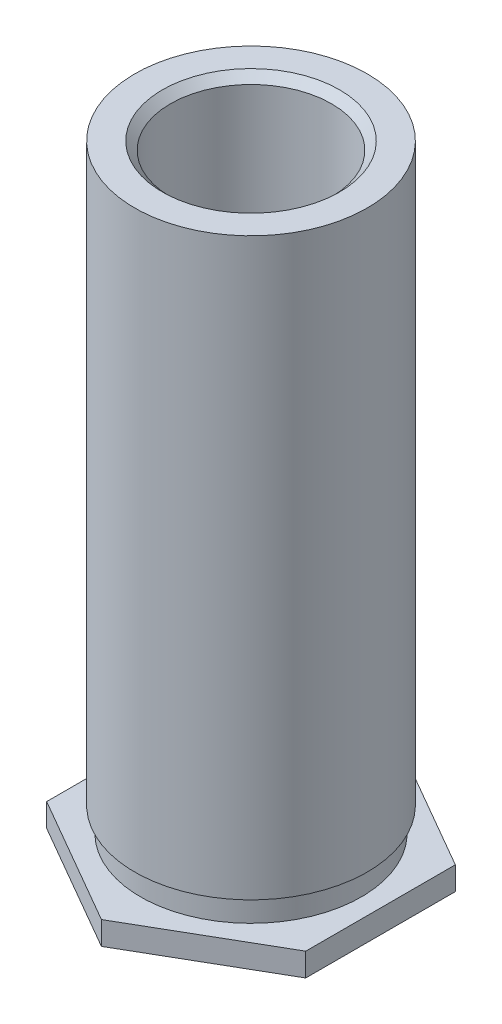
from build123d import *

# Parameters (mm, degrees)
HEXDIESKE_R  = 4.609084
HEXDIE_DEPTH = 0.7112


with BuildPart() as part:
    # BodySke → Body (revolve)
    with BuildSketch(Plane.XY, mode=Mode.PRIVATE) as body_sk:
        Polygon((3.556, 0), (4.596384, 0), (4.596384, 0.7112), (3.3782, 0.7112), (3.3782, 1.45796), (3.556, 1.45796), (3.556, 19.05), (2.71018, 19.05), (2.4638, 18.80362), (2.4638, 0.25146), (2.71018, 0.00508), (3.556, 0.00508), align=None)
    revolve(body_sk.sketch.rotate(Axis((0, 0, 0), (0, 1, 0)), 90), axis=Axis((0, 0, 0), (0, 1, 0)))

    # HexDieSke → HexDie (cut)
    with BuildSketch(Plane(origin=(0, 0.7112, 0), x_dir=(-1, 0, 0), z_dir=(0, 1, 0))):
        Circle(HEXDIESKE_R)
        Polygon((0, 4.575385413), (3.9624, 2.287692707), (3.9624, -2.287692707), (0, -4.575385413), (-3.9624, -2.287692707), (-3.9624, 2.287692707), align=None, mode=Mode.SUBTRACT)
    extrude(amount=-HEXDIE_DEPTH, mode=Mode.SUBTRACT)


solid = part.part
